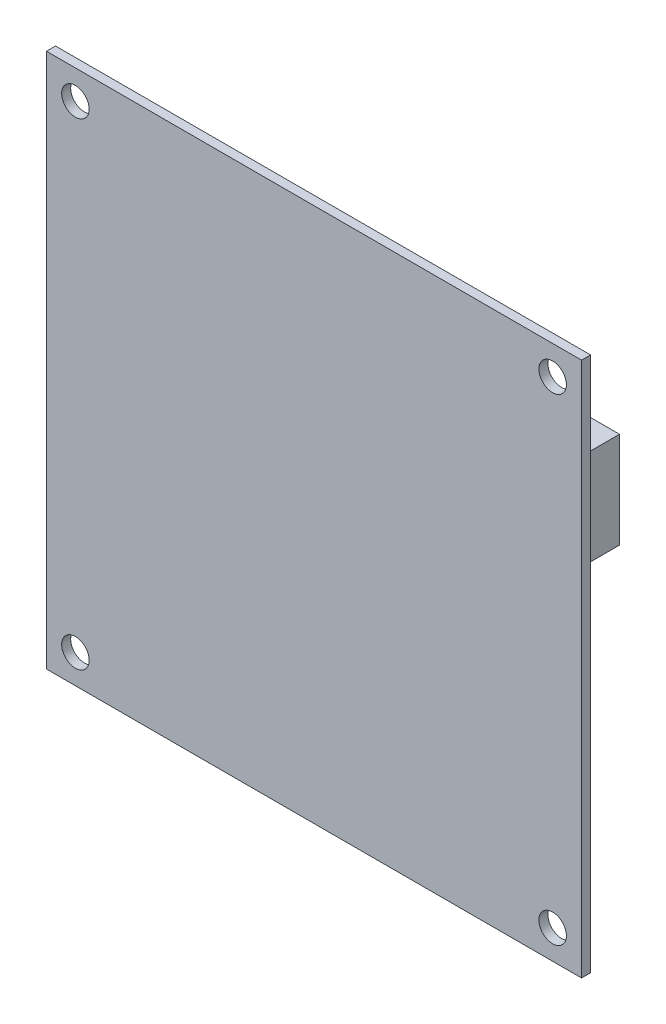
from build123d import *

# Parameters (mm, degrees)
SKETCH1_W           = 93.98
SKETCH1_H           = 93.98
SKETCH1_R           = 2.413
BOSS_EXTRUDE1_DEPTH = 1.5875
SKETCH2_W           = 0.284935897
SKETCH2_H           = 2.320192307
CUT_EXTRUDE1_DEPTH  = 0.127
SKETCH3_W           = 6.5278
SKETCH3_H           = 16.8656
BOSS_EXTRUDE2_DEPTH = 6.35


with BuildPart() as part:
    # Sketch1 → Boss-Extrude1 (new body)
    with BuildSketch(Plane.XY):
        Rectangle(SKETCH1_W, SKETCH1_H)
        with Locations((-41.91, 41.91)):
            Circle(SKETCH1_R, mode=Mode.SUBTRACT)
        with Locations((41.91, 41.91)):
            Circle(SKETCH1_R, mode=Mode.SUBTRACT)
        with Locations((41.91, -41.91)):
            Circle(SKETCH1_R, mode=Mode.SUBTRACT)
        with Locations((-41.91, -41.91)):
            Circle(SKETCH1_R, mode=Mode.SUBTRACT)
    extrude(amount=BOSS_EXTRUDE1_DEPTH)

    # Sketch2 → Cut-Extrude1 (cut)
    # profile 1 of 22: a face of its own
    with BuildSketch(Plane(origin=(0, 0, 0), x_dir=(-1, 0, 0), z_dir=(0, 0, -1))):
        Polygon((28.282190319, -42.83528653), (27.997254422, -42.83528653), (27.997254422, -39.985927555), (26.776100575, -39.985927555), (26.776100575, -39.66028653), (28.282190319, -39.66028653), align=None)
    # profile 2 of 22: a face of its own
    with BuildSketch(Plane(origin=(0, 0, 0), x_dir=(-1, 0, 0), z_dir=(0, 0, -1))):
        Polygon((26.613280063, -42.509645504), (26.613280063, -42.83528653), (24.944369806, -42.83528653), (24.944369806, -42.509645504), (25.636356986, -42.509645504), (25.636356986, -39.66028653), (25.921292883, -39.66028653), (25.921292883, -42.509645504), align=None)
    # profile 3 of 22: a face of its own
    with BuildSketch(Plane(origin=(0, 0, 0), x_dir=(-1, 0, 0), z_dir=(0, 0, -1))):
        with BuildLine():
            Line((21.443728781, -42.252694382), (21.693047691, -42.061889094))
            add(Edge.make_bspline(
                [(21.693047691, -42.061889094), (21.710833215, -42.083085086), (21.746164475, -42.125191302), (21.803002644, -42.184322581), (21.862250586, -42.239702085), (21.923825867, -42.291685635), (21.98915348, -42.338183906), (22.055744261, -42.382818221), (22.126017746, -42.4218971), (22.222699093, -42.469636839), (22.34966794, -42.518367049), (22.508948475, -42.560279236), (22.675450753, -42.586708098), (22.78901852, -42.589589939), (22.846783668, -42.59105576)],
                knots=[0, 0, 0, 0, 0.75789156, 1.505565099, 2.245254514, 2.979266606, 3.711207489, 4.440978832, 5.174393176, 5.91211879, 7.394186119, 8.890401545, 10.418332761, 12, 12, 12, 12], degree=3))
            add(Edge.make_bspline(
                [(22.846783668, -42.59105576), (22.878608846, -42.590687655), (22.941963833, -42.589954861), (23.035993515, -42.580355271), (23.128445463, -42.566707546), (23.21897588, -42.54694963), (23.307405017, -42.521226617), (23.394406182, -42.491060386), (23.478954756, -42.453521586), (23.562068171, -42.41206494), (23.641692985, -42.365226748), (23.717046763, -42.314153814), (23.787789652, -42.259350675), (23.854101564, -42.200946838), (23.915314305, -42.138260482), (23.972078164, -42.071995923), (24.024320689, -42.001853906), (24.071987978, -41.928169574), (24.114623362, -41.851306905), (24.151595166, -41.771596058), (24.182847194, -41.689341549), (24.208200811, -41.60471966), (24.228043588, -41.518029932), (24.241779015, -41.428961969), (24.251290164, -41.337671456), (24.252016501, -41.275796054), (24.252382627, -41.244606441)],
                knots=[0, 0, 0, 0, 1.054960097, 2.100129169, 3.131228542, 4.15308236, 5.169990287, 6.183953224, 7.204064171, 8.235355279, 9.262684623, 10.264978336, 11.252191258, 12.228402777, 13.192898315, 14.155264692, 15.119862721, 16.091023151, 17.063429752, 18.032246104, 19.00241354, 19.978852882, 20.959535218, 21.948948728, 22.966123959, 24, 24, 24, 24], degree=3))
            add(Edge.make_bspline(
                [(24.252382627, -41.244606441), (24.251235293, -41.19767979), (24.248982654, -41.105545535), (24.229019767, -40.970574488), (24.198440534, -40.84114801), (24.153360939, -40.718142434), (24.096666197, -40.600532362), (24.025926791, -40.489744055), (23.943688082, -40.384154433), (23.849106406, -40.286320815), (23.745321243, -40.196956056), (23.633972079, -40.118260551), (23.515331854, -40.052660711), (23.390711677, -39.998072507), (23.25915226, -39.956111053), (23.120890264, -39.926570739), (22.976226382, -39.907301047), (22.877375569, -39.905456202), (22.827067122, -39.904517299)],
                knots=[0, 0, 0, 0, 1.029159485, 2.020618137, 2.987588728, 3.942669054, 4.889339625, 5.846988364, 6.821327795, 7.821533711, 8.827683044, 9.822769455, 10.807800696, 11.797391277, 12.803701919, 13.832062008, 14.896664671, 16, 16, 16, 16], degree=3))
            add(Edge.make_bspline(
                [(22.827067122, -39.904517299), (22.771638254, -39.906049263), (22.662540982, -39.909064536), (22.502549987, -39.934608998), (22.349391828, -39.976027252), (22.203058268, -40.033991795), (22.063961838, -40.109343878), (21.931884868, -40.200691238), (21.806715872, -40.308902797), (21.731449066, -40.391528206), (21.693047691, -40.433683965)],
                knots=[0, 0, 0, 0, 1.028121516, 2.023589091, 2.998037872, 3.967518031, 4.937445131, 5.927275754, 6.942489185, 8, 8, 8, 8], degree=3))
            Line((21.693047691, -40.433683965), (21.443728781, -40.24478673))
            add(Edge.make_bspline(
                [(21.443728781, -40.24478673), (21.463793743, -40.218899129), (21.503827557, -40.167247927), (21.568640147, -40.094417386), (21.636964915, -40.02597163), (21.708986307, -39.962267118), (21.784798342, -39.902985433), (21.864367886, -39.848402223), (21.947298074, -39.797911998), (22.033692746, -39.75214854), (22.123556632, -39.711426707), (22.216119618, -39.675835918), (22.311551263, -39.645950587), (22.40909901, -39.620840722), (22.50976516, -39.602907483), (22.612397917, -39.588635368), (22.717952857, -39.580166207), (22.789103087, -39.579310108), (22.825159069, -39.578876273)],
                knots=[0, 0, 0, 0, 0.986880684, 1.969034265, 2.935876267, 3.899990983, 4.864973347, 5.834408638, 6.8063673, 7.789580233, 8.778939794, 9.778051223, 10.776304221, 11.791326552, 12.811423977, 13.855999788, 14.91350973, 16, 16, 16, 16], degree=3))
            add(Edge.make_bspline(
                [(22.825159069, -39.578876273), (22.859307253, -39.579113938), (22.926831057, -39.57958389), (23.026524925, -39.587196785), (23.123579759, -39.597583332), (23.217718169, -39.613222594), (23.309453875, -39.631677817), (23.397955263, -39.656416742), (23.484093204, -39.684129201), (23.567521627, -39.716700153), (23.648311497, -39.753454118), (23.726202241, -39.794993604), (23.801158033, -39.840969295), (23.873915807, -39.890367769), (23.943400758, -39.94477575), (24.010215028, -40.003437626), (24.074733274, -40.066155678), (24.114649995, -40.111381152), (24.134719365, -40.134119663)],
                knots=[0, 0, 0, 0, 1.114604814, 2.203992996, 3.262667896, 4.300477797, 5.318619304, 6.316056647, 7.298880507, 8.271930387, 9.238335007, 10.195173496, 11.151986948, 12.108099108, 13.064862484, 14.031167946, 15.010108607, 16, 16, 16, 16], degree=3))
            add(Edge.make_bspline(
                [(24.134719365, -40.134119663), (24.16686246, -40.173618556), (24.230760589, -40.252139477), (24.312548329, -40.379386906), (24.382324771, -40.512125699), (24.439371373, -40.651124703), (24.483189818, -40.796437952), (24.513997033, -40.947831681), (24.533876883, -41.105003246), (24.536158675, -41.21189654), (24.537318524, -41.266231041)],
                knots=[0, 0, 0, 0, 0.994611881, 1.977215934, 2.950189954, 3.921972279, 4.908960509, 5.911694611, 6.938501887, 8, 8, 8, 8], degree=3))
            add(Edge.make_bspline(
                [(24.537318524, -41.266231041), (24.535901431, -41.323338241), (24.53311339, -41.435693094), (24.509621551, -41.600622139), (24.471372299, -41.758408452), (24.418702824, -41.909659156), (24.349217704, -42.053508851), (24.265100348, -42.190565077), (24.165529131, -42.320715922), (24.051754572, -42.442297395), (23.926954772, -42.553455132), (23.793317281, -42.651251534), (23.651093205, -42.732637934), (23.501852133, -42.800670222), (23.344475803, -42.85296197), (23.179300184, -42.889568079), (23.006635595, -42.912352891), (22.888831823, -42.915233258), (22.828975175, -42.916696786)],
                knots=[0, 0, 0, 0, 1.032901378, 2.032168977, 3.007206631, 3.966850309, 4.924221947, 5.891988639, 6.871730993, 7.884084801, 8.900290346, 9.89161143, 10.874607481, 11.860025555, 12.854717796, 13.869097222, 14.917278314, 16, 16, 16, 16], degree=3))
            add(Edge.make_bspline(
                [(22.828975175, -42.916696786), (22.792494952, -42.916259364), (22.720286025, -42.915393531), (22.613466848, -42.90695231), (22.509472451, -42.89287639), (22.408013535, -42.87369325), (22.30892275, -42.849833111), (22.212645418, -42.819957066), (22.1194574, -42.783834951), (22.028730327, -42.743631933), (21.941627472, -42.697588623), (21.858192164, -42.647541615), (21.779101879, -42.592527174), (21.703842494, -42.533347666), (21.632761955, -42.469547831), (21.564793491, -42.402200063), (21.501955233, -42.329517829), (21.463173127, -42.278349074), (21.443728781, -42.252694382)],
                knots=[0, 0, 0, 0, 1.096566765, 2.170543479, 3.218870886, 4.250164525, 5.273529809, 6.281496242, 7.278154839, 8.276706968, 9.263143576, 10.238168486, 11.199979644, 12.157579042, 13.114563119, 14.070017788, 15.032356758, 16, 16, 16, 16], degree=3))
        make_face()
    # profile 4 of 22: a face of its own
    with BuildSketch(Plane(origin=(0, 0, 0), x_dir=(-1, 0, 0), z_dir=(0, 0, -1))):
        with BuildLine():
            Line((20.670331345, -41.858363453), (20.955267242, -41.858363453))
            add(Edge.make_bspline(
                [(20.955267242, -41.858363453), (20.953410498, -41.896165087), (20.949763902, -41.970406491), (20.932679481, -42.078647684), (20.908256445, -42.182121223), (20.873643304, -42.279940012), (20.8308991, -42.373272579), (20.778567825, -42.460879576), (20.717765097, -42.543630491), (20.64860246, -42.619958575), (20.573554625, -42.689731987), (20.493071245, -42.750622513), (20.407979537, -42.801480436), (20.319017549, -42.844227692), (20.225156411, -42.876275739), (20.12729333, -42.900065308), (20.024985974, -42.914375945), (19.955281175, -42.91591437), (19.919830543, -42.916696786)],
                knots=[0, 0, 0, 0, 1.100776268, 2.161895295, 3.184016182, 4.190939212, 5.176500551, 6.166955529, 7.155448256, 8.160289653, 9.16017456, 10.133824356, 11.091467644, 12.04088621, 13.000931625, 13.972173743, 14.968683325, 16, 16, 16, 16], degree=3))
            add(Edge.make_bspline(
                [(19.919830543, -42.916696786), (19.885013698, -42.915888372), (19.816599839, -42.914299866), (19.716792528, -42.900453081), (19.621552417, -42.879234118), (19.53195886, -42.847790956), (19.447092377, -42.808336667), (19.368003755, -42.759270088), (19.292780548, -42.702912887), (19.225114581, -42.636436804), (19.162955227, -42.565506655), (19.109377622, -42.489753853), (19.063236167, -42.411423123), (19.025470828, -42.329902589), (18.996843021, -42.244926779), (18.97563256, -42.157310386), (18.963507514, -42.066042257), (18.96165685, -42.004258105), (18.96071596, -41.972846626)],
                knots=[0, 0, 0, 0, 1.111674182, 2.184400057, 3.212814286, 4.223731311, 5.211378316, 6.196328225, 7.191884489, 8.207283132, 9.220262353, 10.201199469, 11.166417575, 12.120932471, 13.06540007, 14.026332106, 14.996573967, 16, 16, 16, 16], degree=3))
            add(Edge.make_bspline(
                [(18.96071596, -41.972846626), (18.962252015, -41.928625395), (18.965297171, -41.840958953), (18.991344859, -41.712130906), (19.032028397, -41.58731508), (19.081007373, -41.486857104), (19.130431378, -41.405917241), (19.174925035, -41.339242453), (19.227308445, -41.267470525), (19.287134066, -41.190310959), (19.355432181, -41.108774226), (19.430428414, -41.021196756), (19.514059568, -40.929197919), (19.572705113, -40.866320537), (19.603093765, -40.833739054)],
                knots=[0, 0, 0, 0, 1.184416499, 2.348048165, 3.509039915, 4.696071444, 5.333504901, 6.05069495, 6.844171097, 7.714965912, 8.667477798, 9.695072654, 10.805644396, 12, 12, 12, 12], degree=3))
            Line((19.603093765, -40.833739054), (20.397479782, -39.985927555))
            Line((20.397479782, -39.985927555), (18.920010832, -39.985927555))
            Line((18.920010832, -39.985927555), (18.920010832, -39.66028653))
            Line((18.920010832, -39.66028653), (21.077382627, -39.66028653))
            Line((21.077382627, -39.66028653), (19.846052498, -40.974298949))
            add(Edge.make_bspline(
                [(19.846052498, -40.974298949), (19.816071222, -41.005592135), (19.758483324, -41.06569994), (19.677065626, -41.153482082), (19.603821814, -41.234823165), (19.538703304, -41.310083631), (19.481656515, -41.378836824), (19.432863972, -41.441621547), (19.392110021, -41.497898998), (19.348919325, -41.564011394), (19.307734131, -41.644826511), (19.27153656, -41.743090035), (19.249623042, -41.844468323), (19.246980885, -41.912956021), (19.245651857, -41.947405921)],
                knots=[0, 0, 0, 0, 1.329530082, 2.553755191, 3.672934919, 4.687409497, 5.60679272, 6.413407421, 7.126401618, 7.737995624, 8.834647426, 9.90044882, 10.943907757, 12, 12, 12, 12], degree=3))
            add(Edge.make_bspline(
                [(19.245651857, -41.947405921), (19.246222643, -41.969072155), (19.247347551, -42.011772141), (19.25746346, -42.074335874), (19.272325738, -42.134919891), (19.2952331, -42.192775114), (19.322755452, -42.249039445), (19.357917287, -42.302002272), (19.39809803, -42.353468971), (19.444705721, -42.40167479), (19.495872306, -42.445838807), (19.54993456, -42.484957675), (19.607129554, -42.517650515), (19.66721893, -42.544450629), (19.73003443, -42.565474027), (19.795697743, -42.580041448), (19.864027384, -42.589187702), (19.910684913, -42.590425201), (19.934458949, -42.59105576)],
                knots=[0, 0, 0, 0, 0.991504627, 1.954065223, 2.895985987, 3.842598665, 4.797835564, 5.759220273, 6.74786863, 7.784730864, 8.824135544, 9.839918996, 10.835834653, 11.835434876, 12.84861661, 13.863796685, 14.911511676, 16, 16, 16, 16], degree=3))
            add(Edge.make_bspline(
                [(19.934458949, -42.59105576), (19.959294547, -42.590432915), (20.00806756, -42.589209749), (20.079523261, -42.579939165), (20.14816678, -42.565899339), (20.212940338, -42.543548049), (20.275199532, -42.517388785), (20.333356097, -42.48351714), (20.389043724, -42.444813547), (20.441142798, -42.399687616), (20.488593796, -42.348747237), (20.531760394, -42.293299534), (20.56833588, -42.232361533), (20.600803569, -42.167395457), (20.625634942, -42.096616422), (20.646863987, -42.021755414), (20.662284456, -41.941744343), (20.667604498, -41.886618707), (20.670331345, -41.858363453)],
                knots=[0, 0, 0, 0, 1.031072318, 2.024855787, 2.988461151, 3.935103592, 4.865765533, 5.788564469, 6.724086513, 7.67908574, 8.64457978, 9.611397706, 10.591395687, 11.591555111, 12.622101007, 13.700900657, 14.821571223, 16, 16, 16, 16], degree=3))
        make_face()
    # profile 5 of 22: a face of its own
    with BuildSketch(Plane(origin=(0, 0, 0), x_dir=(-1, 0, 0), z_dir=(0, 0, -1))):
        Polygon((17.960260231, -42.83528653), (17.37321596, -42.83528653), (17.37321596, -39.66028653), (17.658151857, -39.66028653), (17.658151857, -42.509645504), (18.146613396, -42.509645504), align=None)
    # profile 6 of 22: a face of its own
    with BuildSketch(Plane(origin=(0, 0, 0), x_dir=(-1, 0, 0), z_dir=(0, 0, -1))):
        with BuildLine():
            Line((14.19821596, -42.83528653), (14.19821596, -42.509645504))
            Line((14.19821596, -42.509645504), (15.278173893, -42.509645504))
            Line((15.278173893, -42.509645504), (15.449262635, -41.674554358))
            add(Edge.make_bspline(
                [(15.449262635, -41.674554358), (15.415647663, -41.683834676), (15.350523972, -41.701813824), (15.254403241, -41.721776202), (15.163151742, -41.733809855), (15.103937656, -41.735452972), (15.075284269, -41.736248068)],
                knots=[0, 0, 0, 0, 1.100273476, 2.13160584, 3.095893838, 4, 4, 4, 4], degree=3))
            add(Edge.make_bspline(
                [(15.075284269, -41.736248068), (15.039823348, -41.735505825), (14.970098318, -41.73404639), (14.868238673, -41.719207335), (14.770520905, -41.697699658), (14.678350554, -41.664616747), (14.590241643, -41.623956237), (14.507388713, -41.573408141), (14.429402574, -41.513692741), (14.35645369, -41.446035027), (14.290687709, -41.370705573), (14.233310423, -41.289644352), (14.184266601, -41.203755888), (14.145144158, -41.112250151), (14.113424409, -41.015989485), (14.092451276, -40.914166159), (14.07845809, -40.807627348), (14.076896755, -40.734779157), (14.076100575, -40.697631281)],
                knots=[0, 0, 0, 0, 1.052656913, 2.069786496, 3.052102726, 4.020122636, 4.972424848, 5.930457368, 6.896570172, 7.885826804, 8.881139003, 9.861434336, 10.831623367, 11.813212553, 12.812997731, 13.836986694, 14.897002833, 16, 16, 16, 16], degree=3))
            add(Edge.make_bspline(
                [(14.076100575, -40.697631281), (14.076704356, -40.67175768), (14.077903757, -40.620360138), (14.0839917, -40.544027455), (14.095751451, -40.469319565), (14.111370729, -40.396384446), (14.132139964, -40.325113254), (14.156700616, -40.25533783), (14.186098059, -40.187173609), (14.219644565, -40.12095977), (14.257811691, -40.05799957), (14.298544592, -39.997559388), (14.342929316, -39.941392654), (14.39018888, -39.888560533), (14.44123071, -39.840582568), (14.494802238, -39.795457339), (14.552101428, -39.755098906), (14.612118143, -39.717980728), (14.67481028, -39.684745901), (14.740814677, -39.657022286), (14.808682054, -39.632722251), (14.879017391, -39.612961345), (14.951684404, -39.597629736), (15.026933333, -39.587189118), (15.104386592, -39.579592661), (15.156887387, -39.579116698), (15.183407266, -39.578876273)],
                knots=[0, 0, 0, 0, 1.056281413, 2.098288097, 3.122646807, 4.141030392, 5.140675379, 6.150604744, 7.15845591, 8.168533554, 9.177684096, 10.161739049, 11.141561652, 12.097360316, 13.052218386, 13.998410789, 14.954052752, 15.909851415, 16.877523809, 17.846742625, 18.829312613, 19.818263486, 20.826374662, 21.858017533, 22.918014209, 24, 24, 24, 24], degree=3))
            add(Edge.make_bspline(
                [(15.183407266, -39.578876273), (15.215042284, -39.579504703), (15.277280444, -39.580741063), (15.36847902, -39.593614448), (15.45616894, -39.612178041), (15.539986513, -39.63966625), (15.61953757, -39.675712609), (15.695976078, -39.718265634), (15.767902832, -39.769625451), (15.835828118, -39.827950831), (15.898138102, -39.89264099), (15.955501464, -39.961416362), (16.005170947, -40.035802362), (16.048328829, -40.114557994), (16.085042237, -40.197888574), (16.113909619, -40.285987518), (16.137201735, -40.378426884), (16.14705666, -40.442065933), (16.152062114, -40.474389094)],
                knots=[0, 0, 0, 0, 1.04695683, 2.059763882, 3.044413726, 4.012427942, 4.974081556, 5.932886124, 6.904940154, 7.895678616, 8.893654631, 9.876199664, 10.857615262, 11.850515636, 12.847107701, 13.868396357, 14.917328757, 16, 16, 16, 16], degree=3))
            Line((16.152062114, -40.474389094), (15.867126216, -40.474389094))
            add(Edge.make_bspline(
                [(15.867126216, -40.474389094), (15.860124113, -40.444105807), (15.846665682, -40.385899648), (15.81697047, -40.304218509), (15.781237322, -40.23112804), (15.73677672, -40.167087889), (15.686274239, -40.109942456), (15.627986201, -40.059124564), (15.562407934, -40.013830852), (15.48952479, -39.975767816), (15.412436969, -39.943752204), (15.332227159, -39.920893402), (15.250034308, -39.907059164), (15.194696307, -39.905367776), (15.166870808, -39.904517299)],
                knots=[0, 0, 0, 0, 1.136370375, 2.184166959, 3.172867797, 4.104539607, 5.027679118, 5.956634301, 6.927059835, 7.936867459, 8.959641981, 9.976160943, 10.98235693, 12, 12, 12, 12], degree=3))
            add(Edge.make_bspline(
                [(15.166870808, -39.904517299), (15.139696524, -39.905268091), (15.086190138, -39.906746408), (15.007406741, -39.917941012), (14.931566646, -39.93563486), (14.858535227, -39.960422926), (14.788671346, -39.993216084), (14.722073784, -40.03350059), (14.657793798, -40.08027138), (14.597523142, -40.133728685), (14.54233598, -40.192672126), (14.493570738, -40.25569631), (14.45295188, -40.322931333), (14.4187216, -40.393210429), (14.392728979, -40.467304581), (14.374186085, -40.544866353), (14.363297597, -40.626087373), (14.361799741, -40.681485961), (14.361036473, -40.709715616)],
                knots=[0, 0, 0, 0, 1.027268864, 2.022700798, 3.002744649, 3.968653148, 4.933396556, 5.915045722, 6.907600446, 7.935526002, 8.956456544, 9.95700807, 10.942805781, 11.92166854, 12.907987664, 13.905483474, 14.932689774, 16, 16, 16, 16], degree=3))
            add(Edge.make_bspline(
                [(14.361036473, -40.709715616), (14.361518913, -40.735202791), (14.362459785, -40.784908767), (14.373586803, -40.857562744), (14.38857402, -40.926914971), (14.41221156, -40.992317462), (14.440922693, -41.054453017), (14.47833211, -41.111786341), (14.51969065, -41.167120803), (14.569220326, -41.216798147), (14.622849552, -41.263031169), (14.682280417, -41.302243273), (14.745814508, -41.335605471), (14.81359989, -41.362935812), (14.88571181, -41.384707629), (14.962191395, -41.399754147), (15.043055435, -41.408757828), (15.098369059, -41.409979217), (15.126801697, -41.410607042)],
                knots=[0, 0, 0, 0, 1.045820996, 2.039596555, 3.013371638, 3.9552447, 4.890047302, 5.817684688, 6.761648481, 7.722253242, 8.692244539, 9.66551337, 10.63924952, 11.635311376, 12.662847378, 13.728455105, 14.832366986, 16, 16, 16, 16], degree=3))
            add(Edge.make_bspline(
                [(15.126801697, -41.410607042), (15.151625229, -41.410098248), (15.202442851, -41.409056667), (15.280574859, -41.400859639), (15.362322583, -41.388249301), (15.448003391, -41.37007378), (15.537382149, -41.347316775), (15.630607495, -41.31889613), (15.72768168, -41.286159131), (15.793019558, -41.260767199), (15.826421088, -41.24778653)],
                knots=[0, 0, 0, 0, 0.824638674, 1.688163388, 2.607705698, 3.571998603, 4.597075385, 5.671199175, 6.809488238, 8, 8, 8, 8], degree=3))
            Line((15.826421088, -41.24778653), (15.500780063, -42.83528653))
            Line((15.500780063, -42.83528653), (14.19821596, -42.83528653))
        make_face()
    # profile 7 of 22: a face of its own
    with BuildSketch(Plane(origin=(0, 0, 0), x_dir=(-1, 0, 0), z_dir=(0, 0, -1))):
        with BuildLine():
            Line((12.285074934, -42.916696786), (12.065648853, -42.744336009))
            Line((12.065648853, -42.744336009), (12.904556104, -41.461488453))
            add(Edge.make_bspline(
                [(12.904556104, -41.461488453), (12.848703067, -41.470391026), (12.739755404, -41.487756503), (12.629477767, -41.49062121), (12.57573499, -41.492017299)],
                knots=[0, 0, 0, 0, 1.025318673, 2, 2, 2, 2], degree=3))
            add(Edge.make_bspline(
                [(12.57573499, -41.492017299), (12.543465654, -41.491149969), (12.479944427, -41.489442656), (12.386683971, -41.476303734), (12.29706829, -41.455598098), (12.211468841, -41.425415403), (12.129578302, -41.386859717), (12.050927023, -41.340650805), (11.976992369, -41.2844031), (11.906826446, -41.221568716), (11.843110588, -41.15197982), (11.786743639, -41.078121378), (11.739137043, -40.999999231), (11.701208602, -40.917630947), (11.670897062, -40.831661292), (11.649318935, -40.74175498), (11.636419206, -40.647760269), (11.634677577, -40.583824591), (11.633792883, -40.551347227)],
                knots=[0, 0, 0, 0, 1.043709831, 2.054511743, 3.041122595, 4.01515914, 4.98481438, 5.965901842, 6.960491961, 7.985277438, 9.0096037, 10.00832444, 10.987059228, 11.962929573, 12.936966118, 13.931840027, 14.949438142, 16, 16, 16, 16], degree=3))
            add(Edge.make_bspline(
                [(11.633792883, -40.551347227), (11.635446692, -40.506940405), (11.638699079, -40.419609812), (11.66246408, -40.291909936), (11.703174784, -40.1713013), (11.758516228, -40.057468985), (11.828950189, -39.95279688), (11.913430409, -39.858515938), (12.011539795, -39.77633691), (12.121324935, -39.705869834), (12.2401305, -39.649875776), (12.364706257, -39.60848029), (12.49398225, -39.583744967), (12.58177862, -39.580506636), (12.625980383, -39.578876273)],
                knots=[0, 0, 0, 0, 1.0319111, 2.029359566, 3.00642934, 3.98275322, 4.962714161, 5.929339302, 6.915525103, 7.928435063, 8.953439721, 9.960121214, 10.9730072, 12, 12, 12, 12], degree=3))
            add(Edge.make_bspline(
                [(12.625980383, -39.578876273), (12.668705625, -39.580258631), (12.753336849, -39.58299684), (12.877800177, -39.607516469), (12.99760662, -39.646975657), (13.111215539, -39.702478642), (13.216639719, -39.771398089), (13.31168179, -39.853802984), (13.393936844, -39.949746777), (13.462640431, -40.057439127), (13.518863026, -40.172248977), (13.558146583, -40.293265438), (13.583687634, -40.417980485), (13.586316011, -40.502885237), (13.587639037, -40.545623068)],
                knots=[0, 0, 0, 0, 1.01206923, 2.004731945, 2.994948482, 3.995280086, 4.993424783, 5.973125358, 6.967517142, 7.97830003, 8.994392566, 9.989381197, 10.98793077, 12, 12, 12, 12], degree=3))
            add(Edge.make_bspline(
                [(13.587639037, -40.545623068), (13.586488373, -40.578308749), (13.584139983, -40.645016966), (13.570125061, -40.746340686), (13.544419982, -40.849610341), (13.516601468, -40.937154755), (13.488997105, -41.00965739), (13.463401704, -41.066910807), (13.434782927, -41.127372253), (13.401237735, -41.189897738), (13.365677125, -41.256273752), (13.324138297, -41.324042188), (13.280791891, -41.395678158), (13.249037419, -41.443372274), (13.2327412, -41.467848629)],
                knots=[0, 0, 0, 0, 1.17367173, 2.395347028, 3.66355231, 4.98980831, 5.690886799, 6.447442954, 7.240630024, 8.091733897, 8.994365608, 9.943299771, 10.944512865, 12, 12, 12, 12], degree=3))
            Line((13.2327412, -41.467848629), (12.285074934, -42.916696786))
        make_face()
        with BuildLine():
            add(Edge.make_bspline(
                [(12.635520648, -41.166376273), (12.659708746, -41.165667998), (12.707165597, -41.164278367), (12.776663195, -41.156256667), (12.842477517, -41.141574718), (12.904500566, -41.12090842), (12.963647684, -41.095659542), (13.018979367, -41.063640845), (13.070867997, -41.025987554), (13.118115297, -40.982649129), (13.161511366, -40.935924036), (13.198836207, -40.885569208), (13.231068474, -40.833132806), (13.257266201, -40.778119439), (13.277668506, -40.720565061), (13.292425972, -40.660730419), (13.300639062, -40.598215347), (13.302005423, -40.555822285), (13.30270314, -40.534174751)],
                knots=[0, 0, 0, 0, 1.129540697, 2.216149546, 3.260829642, 4.271906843, 5.264942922, 6.258225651, 7.250175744, 8.252297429, 9.247108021, 10.223125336, 11.173816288, 12.116901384, 13.062424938, 14.020354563, 14.989116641, 16, 16, 16, 16], degree=3))
            add(Edge.make_bspline(
                [(13.30270314, -40.534174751), (13.302113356, -40.512725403), (13.300951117, -40.470456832), (13.291101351, -40.40839684), (13.275246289, -40.348866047), (13.252707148, -40.291738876), (13.223912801, -40.237102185), (13.189473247, -40.184295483), (13.147712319, -40.134724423), (13.100271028, -40.088083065), (13.048720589, -40.04540241), (12.994315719, -40.007243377), (12.936861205, -39.975570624), (12.876968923, -39.949096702), (12.81388644, -39.929647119), (12.748682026, -39.914746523), (12.680457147, -39.906602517), (12.634268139, -39.905221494), (12.61071596, -39.904517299)],
                knots=[0, 0, 0, 0, 0.98953633, 1.950002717, 2.892353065, 3.828177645, 4.777967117, 5.738732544, 6.732276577, 7.76327951, 8.805689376, 9.818183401, 10.825652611, 11.829169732, 12.834974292, 13.867693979, 14.912718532, 16, 16, 16, 16], degree=3))
            add(Edge.make_bspline(
                [(12.61071596, -39.904517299), (12.587163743, -39.905221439), (12.540974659, -39.906602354), (12.472750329, -39.91474714), (12.407543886, -39.929644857), (12.344468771, -39.949104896), (12.284549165, -39.975540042), (12.227044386, -40.007443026), (12.172120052, -40.045171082), (12.120603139, -40.08815687), (12.072963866, -40.134459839), (12.032162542, -40.18474861), (11.996612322, -40.236686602), (11.96891611, -40.291956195), (11.946124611, -40.348832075), (11.930347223, -40.408406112), (11.920476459, -40.470454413), (11.919317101, -40.512724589), (11.918728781, -40.534174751)],
                knots=[0, 0, 0, 0, 1.087095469, 2.131941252, 3.164484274, 4.170116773, 5.173462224, 6.180759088, 7.201132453, 8.243363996, 9.274190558, 10.261329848, 11.227346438, 12.172477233, 13.108141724, 14.050330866, 15.010632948, 16, 16, 16, 16], degree=3))
            add(Edge.make_bspline(
                [(11.918728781, -40.534174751), (11.919222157, -40.555853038), (11.920190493, -40.598400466), (11.931355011, -40.660674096), (11.946434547, -40.721051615), (11.970804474, -40.778172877), (11.999830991, -40.833617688), (12.036809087, -40.885800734), (12.079204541, -40.936202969), (12.128305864, -40.982958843), (12.181711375, -41.025755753), (12.238549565, -41.063420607), (12.297773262, -41.095572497), (12.360219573, -41.120942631), (12.425047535, -41.141381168), (12.492704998, -41.156158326), (12.563240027, -41.164290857), (12.611120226, -41.16567228), (12.635520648, -41.166376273)],
                knots=[0, 0, 0, 0, 0.978317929, 1.920119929, 2.851929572, 3.784133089, 4.71845084, 5.67514162, 6.667477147, 7.690549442, 8.733345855, 9.756283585, 10.767808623, 11.772962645, 12.797066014, 13.836159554, 14.89727653, 16, 16, 16, 16], degree=3))
        make_face(mode=Mode.SUBTRACT)
    # profile 8 of 22: a face of its own
    with BuildSketch(Plane(origin=(0, 0, 0), x_dir=(-1, 0, 0), z_dir=(0, 0, -1))):
        Polygon((9.720651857, -42.83528653), (8.255267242, -39.66028653), (8.565007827, -39.66028653), (9.034388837, -40.677914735), (10.473696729, -40.677914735), (10.956434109, -39.66028653), (11.267446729, -39.66028653), (9.761356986, -42.83528653), align=None)
        Polygon((9.74418451, -42.216441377), (10.319144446, -41.00355576), (9.184488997, -41.00355576), align=None, mode=Mode.SUBTRACT)
    # profile 9 of 22: a face of its own
    with BuildSketch(Plane(origin=(0, 0, 0), x_dir=(-1, 0, 0), z_dir=(0, 0, -1))):
        Polygon((6.545651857, -42.83528653), (4.754626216, -42.83528653), (4.754626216, -42.509645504), (6.26071596, -42.509645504), (6.26071596, -41.532722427), (4.754626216, -41.532722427), (4.754626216, -41.207081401), (6.26071596, -41.207081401), (6.26071596, -39.985927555), (4.754626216, -39.985927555), (4.754626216, -39.66028653), (6.545651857, -39.66028653), align=None)
    # profile 10 of 22: a face of its own
    with BuildSketch(Plane(origin=(0, 0, 0), x_dir=(-1, 0, 0), z_dir=(0, 0, -1))):
        with BuildLine():
            Line((4.266164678, -41.980478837), (3.981228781, -41.980478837))
            Line((3.981228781, -41.980478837), (3.981228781, -41.561979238))
            add(Edge.make_bspline(
                [(3.981228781, -41.561979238), (3.950857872, -41.599993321), (3.892014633, -41.67364511), (3.793012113, -41.769686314), (3.68978194, -41.850280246), (3.580647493, -41.91373638), (3.466731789, -41.961728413), (3.348358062, -41.996336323), (3.224885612, -42.017099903), (3.140916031, -42.019811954), (3.098436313, -42.021183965)],
                knots=[0, 0, 0, 0, 1.127869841, 2.185233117, 3.191641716, 4.159226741, 5.10472073, 6.052603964, 7.014823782, 8, 8, 8, 8], degree=3))
            add(Edge.make_bspline(
                [(3.098436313, -42.021183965), (3.055480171, -42.019690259), (2.971362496, -42.016765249), (2.849328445, -41.99099209), (2.734554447, -41.9502059), (2.628575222, -41.892882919), (2.533021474, -41.821712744), (2.450160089, -41.738229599), (2.380477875, -41.643439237), (2.333968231, -41.554713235), (2.303886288, -41.475901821), (2.284117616, -41.408492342), (2.26812434, -41.333359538), (2.253793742, -41.250689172), (2.24423366, -41.160149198), (2.236655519, -41.061955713), (2.231235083, -40.956125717), (2.231019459, -40.882931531), (2.230908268, -40.845187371)],
                knots=[0, 0, 0, 0, 1.235764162, 2.419900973, 3.574701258, 4.732869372, 5.875730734, 6.993815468, 8.107424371, 9.251605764, 9.866123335, 10.534503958, 11.272175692, 12.077112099, 12.949509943, 13.89253218, 14.913238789, 16, 16, 16, 16], degree=3))
            Line((2.230908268, -40.845187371), (2.230908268, -39.66028653))
            Line((2.230908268, -39.66028653), (2.515844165, -39.66028653))
            Line((2.515844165, -39.66028653), (2.515844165, -40.75169278))
            add(Edge.make_bspline(
                [(2.515844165, -40.75169278), (2.516018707, -40.783281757), (2.516352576, -40.843706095), (2.517419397, -40.930218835), (2.519930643, -41.008464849), (2.523604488, -41.078669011), (2.528746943, -41.140574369), (2.534252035, -41.194494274), (2.540928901, -41.239951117), (2.546882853, -41.26731512), (2.549553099, -41.279587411)],
                knots=[0, 0, 0, 0, 1.430803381, 2.736883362, 3.918614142, 4.976458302, 5.92063272, 6.731858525, 7.431260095, 8, 8, 8, 8], degree=3))
            add(Edge.make_bspline(
                [(2.549553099, -41.279587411), (2.559144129, -41.315637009), (2.577554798, -41.384836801), (2.623973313, -41.47854044), (2.681230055, -41.558964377), (2.752169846, -41.624454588), (2.834887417, -41.675437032), (2.92952028, -41.710784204), (3.035089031, -41.732899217), (3.109343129, -41.735100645), (3.148045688, -41.736248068)],
                knots=[0, 0, 0, 0, 1.084232, 2.08126119, 3.027460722, 3.945137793, 4.874029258, 5.839697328, 6.874011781, 8, 8, 8, 8], degree=3))
            add(Edge.make_bspline(
                [(3.148045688, -41.736248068), (3.170969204, -41.735822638), (3.216334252, -41.734980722), (3.283567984, -41.726314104), (3.348990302, -41.712626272), (3.412425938, -41.692408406), (3.474003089, -41.667826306), (3.533976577, -41.637662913), (3.591508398, -41.601177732), (3.647407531, -41.560168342), (3.699363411, -41.514499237), (3.748396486, -41.467006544), (3.791478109, -41.415701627), (3.830584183, -41.362398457), (3.8643005, -41.306026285), (3.89374268, -41.247187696), (3.918720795, -41.185789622), (3.931133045, -41.143176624), (3.937343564, -41.121855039)],
                knots=[0, 0, 0, 0, 1.023939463, 2.026349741, 3.024227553, 4.007104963, 4.997624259, 5.984875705, 7.002218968, 8.038748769, 9.079772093, 10.091408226, 11.086177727, 12.069739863, 13.043026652, 14.017557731, 15.008077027, 16, 16, 16, 16], degree=3))
            add(Edge.make_bspline(
                [(3.937343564, -41.121855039), (3.940917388, -41.106202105), (3.948697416, -41.072126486), (3.957100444, -41.016206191), (3.964727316, -40.951517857), (3.971110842, -40.878136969), (3.97501647, -40.795806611), (3.979274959, -40.704878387), (3.980825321, -40.604989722), (3.981090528, -40.535446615), (3.981228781, -40.499193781)],
                knots=[0, 0, 0, 0, 0.615963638, 1.340920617, 2.168419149, 3.115676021, 4.16674242, 5.331190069, 6.6087489, 8, 8, 8, 8], degree=3))
            Line((3.981228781, -40.499193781), (3.981228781, -39.66028653))
            Line((3.981228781, -39.66028653), (4.266164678, -39.66028653))
            Line((4.266164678, -39.66028653), (4.266164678, -41.980478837))
        make_face()
    # profile 11 of 22: a face of its own
    with BuildSketch(Plane(origin=(0, 0, 0), x_dir=(-1, 0, 0), z_dir=(0, 0, -1))):
        with BuildLine():
            Line((-0.324610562, -40.392978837), (-0.577745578, -40.260051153))
            add(Edge.make_bspline(
                [(-0.577745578, -40.260051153), (-0.557560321, -40.224281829), (-0.518287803, -40.15468889), (-0.451074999, -40.059023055), (-0.379885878, -39.973767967), (-0.303305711, -39.89932386), (-0.222295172, -39.833941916), (-0.135647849, -39.777919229), (-0.0448055, -39.729278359), (0.051549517, -39.689633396), (0.153325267, -39.658428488), (0.261148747, -39.635393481), (0.375518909, -39.622032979), (0.453839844, -39.62041162), (0.493944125, -39.619581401)],
                knots=[0, 0, 0, 0, 1.120547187, 2.180141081, 3.186367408, 4.148075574, 5.090720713, 6.023293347, 6.960451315, 7.899733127, 8.862572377, 9.862522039, 10.90550313, 12, 12, 12, 12], degree=3))
            add(Edge.make_bspline(
                [(0.493944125, -39.619581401), (0.538522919, -39.620622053), (0.625483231, -39.622652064), (0.752065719, -39.640153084), (0.871245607, -39.668703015), (0.983016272, -39.708586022), (1.087103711, -39.76068088), (1.183715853, -39.82414386), (1.273356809, -39.898650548), (1.353216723, -39.984840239), (1.42506744, -40.077094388), (1.48862595, -40.173160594), (1.541147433, -40.272998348), (1.585976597, -40.375091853), (1.619146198, -40.480799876), (1.643910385, -40.589191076), (1.657785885, -40.700662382), (1.659947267, -40.77603785), (1.661036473, -40.814022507)],
                knots=[0, 0, 0, 0, 1.145213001, 2.233978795, 3.276616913, 4.289988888, 5.2768102, 6.260573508, 7.254647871, 8.264498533, 9.273731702, 10.25749501, 11.220258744, 12.169609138, 13.119022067, 14.062790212, 15.023763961, 16, 16, 16, 16], degree=3))
            add(Edge.make_bspline(
                [(1.661036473, -40.814022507), (1.66007568, -40.849668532), (1.658171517, -40.920314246), (1.646169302, -41.024876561), (1.624898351, -41.126502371), (1.595709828, -41.225276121), (1.558016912, -41.321032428), (1.511904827, -41.413829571), (1.457301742, -41.503568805), (1.415144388, -41.560177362), (1.393909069, -41.588691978)],
                knots=[0, 0, 0, 0, 1.024358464, 2.0301432, 3.019427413, 4.004406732, 4.986367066, 5.972626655, 6.978780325, 8, 8, 8, 8], degree=3))
            add(Edge.make_bspline(
                [(1.393909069, -41.588691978), (1.365195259, -41.623101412), (1.308769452, -41.690719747), (1.212343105, -41.778757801), (1.109337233, -41.854066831), (0.998715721, -41.915504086), (0.880664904, -41.962759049), (0.755793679, -41.996370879), (0.623756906, -42.017285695), (0.533244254, -42.019864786), (0.486947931, -42.021183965)],
                knots=[0, 0, 0, 0, 1.030811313, 2.025658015, 2.997072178, 3.962767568, 4.930766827, 5.917075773, 6.934604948, 8, 8, 8, 8], degree=3))
            add(Edge.make_bspline(
                [(0.486947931, -42.021183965), (0.439367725, -42.019961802), (0.346026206, -42.017564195), (0.209964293, -41.995137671), (0.080966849, -41.960005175), (-0.039901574, -41.908818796), (-0.154503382, -41.845369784), (-0.260201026, -41.765173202), (-0.359895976, -41.672348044), (-0.417864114, -41.600887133), (-0.447361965, -41.564523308)],
                knots=[0, 0, 0, 0, 1.056389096, 2.072394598, 3.055233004, 4.020130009, 4.981825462, 5.957811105, 6.960805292, 8, 8, 8, 8], degree=3))
            add(Edge.make_bspline(
                [(-0.447361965, -41.564523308), (-0.467434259, -41.537124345), (-0.50744524, -41.482508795), (-0.557562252, -41.393453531), (-0.60106646, -41.300280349), (-0.635839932, -41.201483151), (-0.663997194, -41.098232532), (-0.684368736, -40.989790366), (-0.696315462, -40.876188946), (-0.69866378, -40.798785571), (-0.699860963, -40.759324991)],
                knots=[0, 0, 0, 0, 0.94817472, 1.890038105, 2.849395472, 3.817997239, 4.812318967, 5.836947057, 6.897266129, 8, 8, 8, 8], degree=3))
            Line((-0.699860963, -40.759324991), (1.376100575, -40.759324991))
            add(Edge.make_bspline(
                [(1.376100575, -40.759324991), (1.374702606, -40.728754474), (1.371953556, -40.668638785), (1.359167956, -40.580663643), (1.338916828, -40.496899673), (1.310767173, -40.417703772), (1.275470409, -40.342815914), (1.233591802, -40.27171998), (1.183324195, -40.205495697), (1.127349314, -40.143284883), (1.065013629, -40.087904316), (0.999457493, -40.038297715), (0.929820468, -39.996950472), (0.856804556, -39.962883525), (0.780031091, -39.93666332), (0.699608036, -39.918607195), (0.615785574, -39.906544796), (0.558649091, -39.905201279), (0.529561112, -39.904517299)],
                knots=[0, 0, 0, 0, 1.094405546, 2.152104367, 3.174987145, 4.173015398, 5.153654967, 6.133208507, 7.119289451, 8.123438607, 9.122504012, 10.097966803, 11.060604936, 12.014205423, 12.976096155, 13.956823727, 14.959826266, 16, 16, 16, 16], degree=3))
            add(Edge.make_bspline(
                [(0.529561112, -39.904517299), (0.501119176, -39.905060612), (0.444684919, -39.906138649), (0.360469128, -39.916929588), (0.277423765, -39.933748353), (0.196625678, -39.958152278), (0.119368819, -39.987013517), (0.047221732, -40.020759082), (-0.019138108, -40.058794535), (-0.081041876, -40.102691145), (-0.140759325, -40.156005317), (-0.200188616, -40.222661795), (-0.263340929, -40.301966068), (-0.303418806, -40.361499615), (-0.324610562, -40.392978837)],
                knots=[0, 0, 0, 0, 0.991026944, 1.966387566, 2.954903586, 3.941705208, 4.905318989, 5.827751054, 6.715113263, 7.568237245, 8.468614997, 9.499196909, 10.677664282, 12, 12, 12, 12], degree=3))
        make_face()
        with BuildLine():
            add(Edge.make_bspline(
                [(-0.414925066, -41.044260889), (-0.404555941, -41.082082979), (-0.384650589, -41.154689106), (-0.341990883, -41.254960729), (-0.296175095, -41.345101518), (-0.239912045, -41.422832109), (-0.17623947, -41.491499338), (-0.102465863, -41.551145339), (-0.021028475, -41.605856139), (0.069553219, -41.651464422), (0.165778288, -41.688930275), (0.265648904, -41.716482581), (0.36833403, -41.732677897), (0.437494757, -41.735052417), (0.472319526, -41.736248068)],
                knots=[0, 0, 0, 0, 1.154958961, 2.217145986, 3.207012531, 4.129872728, 5.036522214, 5.960144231, 6.920619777, 7.92424629, 8.943461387, 9.961007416, 10.973298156, 12, 12, 12, 12], degree=3))
            add(Edge.make_bspline(
                [(0.472319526, -41.736248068), (0.500759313, -41.735697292), (0.556978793, -41.734608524), (0.639782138, -41.724144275), (0.719652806, -41.707106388), (0.796207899, -41.682728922), (0.869620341, -41.652075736), (0.940226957, -41.61518486), (1.007177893, -41.570298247), (1.049031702, -41.536038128), (1.070176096, -41.518730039)],
                knots=[0, 0, 0, 0, 1.04879286, 2.073242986, 3.073461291, 4.057960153, 5.032623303, 6.005244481, 6.992256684, 8, 8, 8, 8], degree=3))
            add(Edge.make_bspline(
                [(1.070176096, -41.518730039), (1.085321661, -41.505038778), (1.115972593, -41.477331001), (1.156884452, -41.42956633), (1.196348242, -41.378031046), (1.231417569, -41.320475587), (1.264745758, -41.258568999), (1.29511638, -41.191859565), (1.322730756, -41.120065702), (1.338232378, -41.070012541), (1.346207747, -41.044260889)],
                knots=[0, 0, 0, 0, 0.879905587, 1.780714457, 2.708106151, 3.677566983, 4.684151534, 5.740052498, 6.837288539, 8, 8, 8, 8], degree=3))
            Line((1.346207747, -41.044260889), (-0.414925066, -41.044260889))
        make_face(mode=Mode.SUBTRACT)
    # profile 12 of 22: a face of its own
    with BuildSketch(Plane(origin=(0, 0, 0), x_dir=(-1, 0, 0), z_dir=(0, 0, -1))):
        with BuildLine():
            Line((-1.188322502, -41.980478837), (-1.473258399, -41.980478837))
            Line((-1.473258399, -41.980478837), (-1.473258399, -41.638937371))
            add(Edge.make_bspline(
                [(-1.473258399, -41.638937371), (-1.494277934, -41.670755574), (-1.534477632, -41.731607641), (-1.601647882, -41.811928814), (-1.669695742, -41.879490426), (-1.740936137, -41.932039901), (-1.813557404, -41.972084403), (-1.887344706, -42.000464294), (-1.962830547, -42.017762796), (-2.013785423, -42.020042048), (-2.039314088, -42.021183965)],
                knots=[0, 0, 0, 0, 1.280240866, 2.448450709, 3.511242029, 4.49418232, 5.41222037, 6.289222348, 7.142891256, 8, 8, 8, 8], degree=3))
            add(Edge.make_bspline(
                [(-2.039314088, -42.021183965), (-2.059120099, -42.020128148), (-2.099665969, -42.017966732), (-2.16123023, -42.002020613), (-2.224921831, -41.977527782), (-2.266023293, -41.953931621), (-2.287360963, -41.941681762)],
                knots=[0, 0, 0, 0, 0.90119973, 1.844890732, 2.881183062, 4, 4, 4, 4], degree=3))
            Line((-2.287360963, -41.941681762), (-2.130900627, -41.694906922))
            add(Edge.make_bspline(
                [(-2.130900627, -41.694906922), (-2.117194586, -41.701021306), (-2.091177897, -41.712627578), (-2.053119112, -41.726363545), (-2.018029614, -41.734451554), (-1.995674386, -41.735676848), (-1.98525259, -41.736248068)],
                knots=[0, 0, 0, 0, 1.180555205, 2.24091978, 3.179933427, 4, 4, 4, 4], degree=3))
            add(Edge.make_bspline(
                [(-1.98525259, -41.736248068), (-1.962150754, -41.734792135), (-1.915450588, -41.731848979), (-1.847215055, -41.706702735), (-1.78011589, -41.668909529), (-1.728004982, -41.624329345), (-1.687205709, -41.582322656), (-1.657845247, -41.545356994), (-1.631476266, -41.503551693), (-1.605902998, -41.458490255), (-1.582142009, -41.409051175), (-1.560908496, -41.355151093), (-1.541050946, -41.297235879), (-1.52986811, -41.256966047), (-1.524139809, -41.236338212)],
                knots=[0, 0, 0, 0, 1.1355652, 2.295535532, 3.545064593, 4.917862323, 5.656949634, 6.430545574, 7.239270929, 8.090880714, 8.983622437, 9.940313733, 10.94494545, 12, 12, 12, 12], degree=3))
            add(Edge.make_bspline(
                [(-1.524139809, -41.236338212), (-1.519839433, -41.217944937), (-1.510266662, -41.177000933), (-1.501207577, -41.108622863), (-1.491896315, -41.027888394), (-1.48553766, -40.934703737), (-1.479531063, -40.828710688), (-1.476212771, -40.7103665), (-1.473363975, -40.579345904), (-1.473294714, -40.487959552), (-1.473258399, -40.440044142)],
                knots=[0, 0, 0, 0, 0.566841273, 1.261806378, 2.068780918, 3.007109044, 4.065315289, 5.256255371, 6.561408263, 8, 8, 8, 8], degree=3))
            Line((-1.473258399, -40.440044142), (-1.473258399, -39.66028653))
            Line((-1.473258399, -39.66028653), (-1.188322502, -39.66028653))
            Line((-1.188322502, -39.66028653), (-1.188322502, -41.980478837))
        make_face()
    # profile 13 of 22: a face of its own
    with BuildSketch(Plane(origin=(0, 0, 0), x_dir=(-1, 0, 0), z_dir=(0, 0, -1))):
        with BuildLine():
            Line((-4.607553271, -41.980478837), (-4.892489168, -41.980478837))
            Line((-4.892489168, -41.980478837), (-4.892489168, -40.139207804))
            add(Edge.make_bspline(
                [(-4.892489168, -40.139207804), (-4.892237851, -40.099985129), (-4.891752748, -40.024275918), (-4.888259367, -39.914803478), (-4.880892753, -39.813687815), (-4.872539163, -39.720467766), (-4.860522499, -39.635575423), (-4.845848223, -39.558757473), (-4.829305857, -39.489940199), (-4.814773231, -39.447554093), (-4.807898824, -39.427504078)],
                knots=[0, 0, 0, 0, 1.307562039, 2.523909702, 3.650326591, 4.686913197, 5.643429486, 6.506965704, 7.293745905, 8, 8, 8, 8], degree=3))
            add(Edge.make_bspline(
                [(-4.807898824, -39.427504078), (-4.797749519, -39.401441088), (-4.777754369, -39.350094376), (-4.740288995, -39.277322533), (-4.698397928, -39.208746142), (-4.650395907, -39.145129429), (-4.597439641, -39.085543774), (-4.538871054, -39.030848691), (-4.474833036, -38.981112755), (-4.405899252, -38.935864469), (-4.332560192, -38.895429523), (-4.255217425, -38.860185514), (-4.174064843, -38.831039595), (-4.089461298, -38.807007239), (-4.001369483, -38.787632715), (-3.909507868, -38.774702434), (-3.814183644, -38.76599668), (-3.749373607, -38.765185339), (-3.716492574, -38.764773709)],
                knots=[0, 0, 0, 0, 0.981980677, 1.934600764, 2.870922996, 3.801898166, 4.730277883, 5.66822786, 6.612778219, 7.575390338, 8.562104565, 9.552017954, 10.558022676, 11.588218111, 12.640020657, 13.7238485, 14.84520645, 16, 16, 16, 16], degree=3))
            add(Edge.make_bspline(
                [(-3.716492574, -38.764773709), (-3.668531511, -38.765646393), (-3.574875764, -38.767350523), (-3.438057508, -38.783695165), (-3.308710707, -38.809895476), (-3.187705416, -38.847613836), (-3.075962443, -38.89405789), (-2.973844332, -38.946839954), (-2.883055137, -39.008001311), (-2.801286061, -39.07737113), (-2.727501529, -39.159895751), (-2.658079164, -39.257138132), (-2.591258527, -39.370592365), (-2.552098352, -39.453861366), (-2.531591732, -39.497466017)],
                knots=[0, 0, 0, 0, 1.157891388, 2.261067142, 3.322482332, 4.341146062, 5.316743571, 6.242014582, 7.11254001, 7.955027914, 8.825041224, 9.77858257, 10.836732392, 12, 12, 12, 12], degree=3))
            Line((-2.531591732, -39.497466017), (-2.81652763, -39.497466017))
            add(Edge.make_bspline(
                [(-2.81652763, -39.497466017), (-2.839454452, -39.461095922), (-2.884273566, -39.389996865), (-2.967808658, -39.297847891), (-3.060028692, -39.219819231), (-3.162890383, -39.156507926), (-3.277111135, -39.107768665), (-3.403429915, -39.073914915), (-3.542192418, -39.053433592), (-3.638824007, -39.050984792), (-3.689143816, -39.049709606)],
                knots=[0, 0, 0, 0, 0.997887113, 1.950746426, 2.877762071, 3.798308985, 4.747694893, 5.754452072, 6.830656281, 8, 8, 8, 8], degree=3))
            add(Edge.make_bspline(
                [(-3.689143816, -39.049709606), (-3.738828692, -39.050995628), (-3.834616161, -39.053474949), (-3.97250485, -39.074014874), (-4.098662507, -39.107684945), (-4.211475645, -39.156230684), (-4.309868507, -39.215015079), (-4.395474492, -39.27940099), (-4.464313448, -39.353134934), (-4.510805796, -39.420929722), (-4.53967643, -39.481373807), (-4.558079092, -39.533397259), (-4.572920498, -39.592036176), (-4.585660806, -39.657430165), (-4.595756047, -39.729604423), (-4.602379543, -39.808805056), (-4.607080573, -39.894496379), (-4.607392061, -39.953907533), (-4.607553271, -39.98465552)],
                knots=[0, 0, 0, 0, 1.570812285, 3.028368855, 4.398074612, 5.689726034, 6.898366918, 8.016954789, 9.065347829, 10.075205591, 10.603066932, 11.179971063, 11.817519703, 12.514501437, 13.286417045, 14.121160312, 15.027614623, 16, 16, 16, 16], degree=3))
            Line((-4.607553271, -39.98465552), (-4.607553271, -40.104862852))
            add(Edge.make_bspline(
                [(-4.607553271, -40.104862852), (-4.578622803, -40.070458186), (-4.521270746, -40.002254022), (-4.422492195, -39.912722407), (-4.313920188, -39.836545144), (-4.197089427, -39.773180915), (-4.073741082, -39.722978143), (-3.946055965, -39.686601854), (-3.814392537, -39.664038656), (-3.725274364, -39.661546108), (-3.680239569, -39.66028653)],
                knots=[0, 0, 0, 0, 1.012670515, 2.007528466, 2.995541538, 3.996581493, 4.997861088, 5.991949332, 6.98525577, 8, 8, 8, 8], degree=3))
            add(Edge.make_bspline(
                [(-3.680239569, -39.66028653), (-3.653728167, -39.660846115), (-3.601038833, -39.661958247), (-3.522540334, -39.668723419), (-3.445554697, -39.681897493), (-3.369591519, -39.698766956), (-3.295181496, -39.721379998), (-3.221433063, -39.747920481), (-3.14941721, -39.780519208), (-3.078766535, -39.817220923), (-3.011143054, -39.858457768), (-2.946760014, -39.903011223), (-2.886011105, -39.950784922), (-2.829467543, -40.002218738), (-2.777176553, -40.057228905), (-2.728548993, -40.115296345), (-2.68402476, -40.176878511), (-2.644180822, -40.241999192), (-2.607779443, -40.309070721), (-2.576613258, -40.378414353), (-2.550741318, -40.449591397), (-2.527940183, -40.52171203), (-2.511794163, -40.5960914), (-2.499447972, -40.671847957), (-2.492520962, -40.749443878), (-2.491433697, -40.801713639), (-2.490886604, -40.828014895)],
                knots=[0, 0, 0, 0, 1.028752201, 2.044564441, 3.053391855, 4.057142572, 5.061701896, 6.068783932, 7.096088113, 8.1262863, 9.156123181, 10.166960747, 11.162589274, 12.152492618, 13.129945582, 14.10521553, 15.089188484, 16.075359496, 17.065365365, 18.04840954, 19.021769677, 20.00271226, 20.980580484, 21.971849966, 22.979469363, 24, 24, 24, 24], degree=3))
            add(Edge.make_bspline(
                [(-2.490886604, -40.828014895), (-2.491357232, -40.854324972), (-2.492296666, -40.906843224), (-2.500421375, -40.984746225), (-2.511985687, -41.061614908), (-2.530384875, -41.136615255), (-2.552216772, -41.210830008), (-2.580531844, -41.283050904), (-2.613154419, -41.354233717), (-2.650440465, -41.423754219), (-2.692178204, -41.490972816), (-2.738120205, -41.5545128), (-2.78730605, -41.614902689), (-2.84072559, -41.671367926), (-2.898063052, -41.724331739), (-2.959485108, -41.773329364), (-3.024308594, -41.819246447), (-3.092755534, -41.861075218), (-3.163764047, -41.898070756), (-3.23553165, -41.931827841), (-3.309008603, -41.958619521), (-3.382825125, -41.982226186), (-3.45828119, -41.998949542), (-3.534451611, -42.011851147), (-3.61159716, -42.019711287), (-3.663261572, -42.020692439), (-3.689143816, -42.021183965)],
                knots=[0, 0, 0, 0, 1.008914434, 2.013921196, 3.001938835, 3.98818112, 4.973517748, 5.967241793, 6.960633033, 7.975722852, 8.991170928, 9.993245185, 10.981396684, 11.976616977, 12.972235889, 13.973022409, 14.988340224, 16.01763096, 17.047082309, 18.058647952, 19.057085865, 20.044802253, 21.029198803, 22.0185208, 23.007341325, 24, 24, 24, 24], degree=3))
            add(Edge.make_bspline(
                [(-3.689143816, -42.021183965), (-3.731829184, -42.019972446), (-3.815909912, -42.01758602), (-3.939893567, -41.998279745), (-4.059661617, -41.968188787), (-4.175827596, -41.92444591), (-4.28910057, -41.865249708), (-4.398798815, -41.786274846), (-4.506800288, -41.689081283), (-4.573113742, -41.613797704), (-4.607553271, -41.57469959)],
                knots=[0, 0, 0, 0, 0.967343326, 1.905452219, 2.838102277, 3.762990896, 4.713322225, 5.726933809, 6.819495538, 8, 8, 8, 8], degree=3))
            Line((-4.607553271, -41.57469959), (-4.607553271, -41.980478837))
        make_face()
        with BuildLine():
            add(Edge.make_bspline(
                [(-3.71204045, -41.736248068), (-3.670377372, -41.734826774), (-3.587893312, -41.732012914), (-3.466943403, -41.708153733), (-3.350446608, -41.670390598), (-3.239557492, -41.617825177), (-3.136808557, -41.551404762), (-3.04491866, -41.472335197), (-2.964652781, -41.382000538), (-2.897578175, -41.280708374), (-2.843491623, -41.171760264), (-2.804684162, -41.057117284), (-2.779895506, -40.938259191), (-2.777188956, -40.857393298), (-2.775822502, -40.816566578)],
                knots=[0, 0, 0, 0, 1.026297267, 2.031850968, 3.02682269, 4.039104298, 5.04807494, 6.033889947, 7.01870694, 8.017446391, 9.02017099, 10.008531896, 10.994568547, 12, 12, 12, 12], degree=3))
            add(Edge.make_bspline(
                [(-2.775822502, -40.816566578), (-2.776483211, -40.785785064), (-2.777782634, -40.725246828), (-2.790198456, -40.63639159), (-2.810488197, -40.55162035), (-2.838598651, -40.471070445), (-2.874285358, -40.394423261), (-2.91935891, -40.322574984), (-2.971535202, -40.254232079), (-3.03133434, -40.190869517), (-3.097139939, -40.133078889), (-3.168466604, -40.082563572), (-3.244927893, -40.040680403), (-3.325300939, -40.005019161), (-3.411287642, -39.978785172), (-3.501598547, -39.958803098), (-3.596839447, -39.947362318), (-3.661765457, -39.945945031), (-3.694867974, -39.945222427)],
                knots=[0, 0, 0, 0, 1.039874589, 2.045129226, 3.025325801, 3.981633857, 4.924015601, 5.876477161, 6.842427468, 7.825840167, 8.816042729, 9.798123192, 10.773172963, 11.758281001, 12.764505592, 13.805958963, 14.88136847, 16, 16, 16, 16], degree=3))
            add(Edge.make_bspline(
                [(-3.694867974, -39.945222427), (-3.728399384, -39.945918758), (-3.793969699, -39.947280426), (-3.889737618, -39.958985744), (-3.980481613, -39.977874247), (-4.066118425, -40.004692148), (-4.146971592, -40.038911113), (-4.222132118, -40.082215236), (-4.293214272, -40.131530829), (-4.357938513, -40.189057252), (-4.416494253, -40.252443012), (-4.467418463, -40.321463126), (-4.511154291, -40.394785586), (-4.545963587, -40.473345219), (-4.574677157, -40.556103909), (-4.592779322, -40.644457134), (-4.605762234, -40.737104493), (-4.606947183, -40.800617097), (-4.607553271, -40.833103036)],
                knots=[0, 0, 0, 0, 1.121992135, 2.194043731, 3.223932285, 4.220423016, 5.193184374, 6.156086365, 7.118779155, 8.084057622, 9.048292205, 10.002025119, 10.950065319, 11.899697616, 12.87359713, 13.875731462, 14.913461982, 16, 16, 16, 16], degree=3))
            add(Edge.make_bspline(
                [(-4.607553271, -40.833103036), (-4.606335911, -40.875391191), (-4.603957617, -40.958007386), (-4.581584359, -41.078403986), (-4.545291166, -41.191723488), (-4.494921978, -41.297675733), (-4.431513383, -41.39478567), (-4.354391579, -41.480591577), (-4.266972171, -41.557469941), (-4.16710554, -41.620652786), (-4.060067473, -41.67235164), (-3.94762496, -41.709378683), (-3.831007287, -41.731683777), (-3.751994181, -41.7347152), (-3.71204045, -41.736248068)],
                knots=[0, 0, 0, 0, 1.070694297, 2.091760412, 3.090724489, 4.078342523, 5.055782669, 6.018541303, 6.993409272, 7.996294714, 9.003086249, 9.99860646, 10.987976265, 12, 12, 12, 12], degree=3))
        make_face(mode=Mode.SUBTRACT)
    # profile 14 of 22: a face of its own
    with BuildSketch(Plane(origin=(0, 0, 0), x_dir=(-1, 0, 0), z_dir=(0, 0, -1))):
        Polygon((-5.29954045, -41.980478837), (-5.606736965, -41.980478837), (-6.392218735, -40.203445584), (-7.189784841, -41.980478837), (-7.497617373, -41.980478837), (-6.072937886, -38.805478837), (-5.765105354, -38.805478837), (-6.237666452, -39.858088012), align=None)
    # profile 15 of 22: a face of its own
    with BuildSketch(Plane(origin=(0, 0, 0), x_dir=(-1, 0, 0), z_dir=(0, 0, -1))):
        Polygon((-9.044412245, -39.66028653), (-9.463547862, -42.83528653), (-9.50425299, -42.83528653), (-10.815085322, -40.230158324), (-12.122737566, -42.83528653), (-12.164078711, -42.83528653), (-12.585758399, -39.66028653), (-12.299550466, -39.66028653), (-11.99553404, -41.94486185), (-10.849430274, -39.66028653), (-10.785192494, -39.66028653), (-9.634636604, -41.949949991), (-9.331256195, -39.66028653), align=None)
    # profile 16 of 22: a face of its own
    with BuildSketch(Plane(origin=(0, 0, 0), x_dir=(-1, 0, 0), z_dir=(0, 0, -1))):
        with BuildLine():
            add(Edge.make_bspline(
                [(-14.276293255, -42.021183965), (-14.319829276, -42.020259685), (-14.405192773, -42.018447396), (-14.530188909, -41.99898244), (-14.649381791, -41.969465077), (-14.763282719, -41.927915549), (-14.870949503, -41.873400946), (-14.973343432, -41.807476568), (-15.070259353, -41.729696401), (-15.128334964, -41.669495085), (-15.157813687, -41.638937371)],
                knots=[0, 0, 0, 0, 1.054042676, 2.066720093, 3.05716247, 4.025731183, 4.997454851, 5.974904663, 6.97207755, 8, 8, 8, 8], degree=3))
            add(Edge.make_bspline(
                [(-15.157813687, -41.638937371), (-15.183197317, -41.609714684), (-15.233473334, -41.551834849), (-15.297940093, -41.457985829), (-15.353476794, -41.360794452), (-15.397983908, -41.258970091), (-15.433076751, -41.153401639), (-15.457992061, -41.043726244), (-15.472811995, -40.930186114), (-15.474810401, -40.85307549), (-15.475822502, -40.814022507)],
                knots=[0, 0, 0, 0, 1.025258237, 2.030674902, 3.01204498, 3.988269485, 4.97094183, 5.956517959, 6.965070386, 8, 8, 8, 8], degree=3))
            add(Edge.make_bspline(
                [(-15.475822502, -40.814022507), (-15.474932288, -40.774743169), (-15.473173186, -40.697125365), (-15.456532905, -40.582807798), (-15.430651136, -40.471959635), (-15.39361082, -40.365044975), (-15.346114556, -40.261736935), (-15.288156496, -40.162487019), (-15.219330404, -40.067098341), (-15.141311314, -39.97638499), (-15.05509008, -39.892767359), (-14.961533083, -39.8199333), (-14.862411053, -39.75727103), (-14.756370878, -39.707499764), (-14.644922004, -39.667380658), (-14.527355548, -39.639715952), (-14.403776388, -39.62283973), (-14.319385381, -39.620682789), (-14.276293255, -39.619581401)],
                knots=[0, 0, 0, 0, 0.998669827, 1.973418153, 2.932281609, 3.89081133, 4.846438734, 5.82045571, 6.809776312, 7.834649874, 8.860672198, 9.859676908, 10.845817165, 11.837296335, 12.833502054, 13.853824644, 14.904110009, 16, 16, 16, 16], degree=3))
            add(Edge.make_bspline(
                [(-14.276293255, -39.619581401), (-14.232992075, -39.620691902), (-14.148184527, -39.622866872), (-14.024140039, -39.639590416), (-13.906078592, -39.667676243), (-13.794102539, -39.707003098), (-13.688062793, -39.757679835), (-13.588574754, -39.819689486), (-13.494973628, -39.892804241), (-13.408725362, -39.976374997), (-13.33071352, -40.067100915), (-13.261885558, -40.162486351), (-13.203927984, -40.26173711), (-13.156431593, -40.365044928), (-13.119391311, -40.471959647), (-13.093509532, -40.582807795), (-13.076869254, -40.697125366), (-13.075110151, -40.774743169), (-13.074219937, -40.814022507)],
                knots=[0, 0, 0, 0, 1.099861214, 2.154133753, 3.1731438, 4.178222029, 5.163564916, 6.153006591, 7.15072618, 8.175428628, 9.198983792, 10.187031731, 11.15979573, 12.114193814, 13.071490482, 14.029120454, 15.002614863, 16, 16, 16, 16], degree=3))
            add(Edge.make_bspline(
                [(-13.074219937, -40.814022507), (-13.075236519, -40.852864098), (-13.077249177, -40.929763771), (-13.092089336, -41.043077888), (-13.116733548, -41.152417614), (-13.152312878, -41.257409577), (-13.196737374, -41.358989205), (-13.251715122, -41.456536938), (-13.316805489, -41.549975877), (-13.366886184, -41.607778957), (-13.392228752, -41.637029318)],
                knots=[0, 0, 0, 0, 1.031377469, 2.041950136, 3.029500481, 4.003457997, 4.981637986, 5.969878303, 6.97268806, 8, 8, 8, 8], degree=3))
            add(Edge.make_bspline(
                [(-13.392228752, -41.637029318), (-13.421665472, -41.667846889), (-13.479557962, -41.728455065), (-13.576921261, -41.806081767), (-13.678874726, -41.872894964), (-13.787235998, -41.927382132), (-13.901453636, -41.969389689), (-14.021532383, -41.999120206), (-14.146983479, -42.018361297), (-14.232760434, -42.020233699), (-14.276293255, -42.021183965)],
                knots=[0, 0, 0, 0, 1.027951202, 2.021646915, 2.998468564, 3.9668038, 4.943370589, 5.93035926, 6.949632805, 8, 8, 8, 8], degree=3))
        make_face()
        with BuildLine():
            add(Edge.make_bspline(
                [(-14.275021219, -41.736248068), (-14.244234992, -41.735372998), (-14.183457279, -41.733645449), (-14.09399473, -41.72050716), (-14.007872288, -41.699687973), (-13.924915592, -41.670120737), (-13.845445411, -41.63189591), (-13.769374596, -41.585210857), (-13.696906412, -41.529817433), (-13.62860187, -41.46681469), (-13.565166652, -41.398388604), (-13.510398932, -41.324788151), (-13.46347984, -41.24805847), (-13.425143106, -41.167765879), (-13.395731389, -41.083689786), (-13.374892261, -40.996311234), (-13.361729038, -40.90537016), (-13.360022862, -40.843536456), (-13.359155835, -40.812114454)],
                knots=[0, 0, 0, 0, 1.021608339, 2.016844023, 2.99486249, 3.958675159, 4.934437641, 5.916902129, 6.916234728, 7.957219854, 8.998204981, 10.008773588, 10.997243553, 11.979355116, 12.956436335, 13.948132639, 14.957303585, 16, 16, 16, 16], degree=3))
            add(Edge.make_bspline(
                [(-13.359155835, -40.812114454), (-13.360609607, -40.771516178), (-13.363495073, -40.690936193), (-13.387078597, -40.572298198), (-13.426251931, -40.458188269), (-13.480269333, -40.349980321), (-13.546793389, -40.249688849), (-13.624579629, -40.159506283), (-13.714703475, -40.082910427), (-13.814096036, -40.018492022), (-13.921348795, -39.967762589), (-14.034663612, -39.93138284), (-14.153008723, -39.908052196), (-14.233994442, -39.90570591), (-14.275021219, -39.904517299)],
                knots=[0, 0, 0, 0, 1.016977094, 2.018509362, 3.018404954, 4.033172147, 5.041280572, 6.028085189, 7.007940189, 7.995502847, 8.989109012, 9.972200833, 10.97273166, 12, 12, 12, 12], degree=3))
            add(Edge.make_bspline(
                [(-14.275021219, -39.904517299), (-14.316050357, -39.905699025), (-14.397040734, -39.90803172), (-14.515550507, -39.931501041), (-14.629175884, -39.967604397), (-14.736540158, -40.018549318), (-14.835977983, -40.082666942), (-14.925458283, -40.159942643), (-15.003914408, -40.249451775), (-15.070504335, -40.349847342), (-15.123651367, -40.458356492), (-15.163008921, -40.572277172), (-15.186535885, -40.690941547), (-15.189428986, -40.771517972), (-15.190886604, -40.812114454)],
                knots=[0, 0, 0, 0, 1.027082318, 2.027431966, 3.015401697, 4.008827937, 4.996211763, 5.971861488, 6.96198607, 7.969911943, 8.982141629, 9.981856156, 10.983207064, 12, 12, 12, 12], degree=3))
            add(Edge.make_bspline(
                [(-15.190886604, -40.812114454), (-15.190026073, -40.843538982), (-15.188332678, -40.905377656), (-15.175076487, -40.996282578), (-15.154564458, -41.083863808), (-15.123884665, -41.167426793), (-15.086883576, -41.248449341), (-15.038826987, -41.324558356), (-14.984314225, -41.398435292), (-14.920762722, -41.466773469), (-14.852465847, -41.530047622), (-14.779453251, -41.585009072), (-14.703347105, -41.63192257), (-14.62385181, -41.670125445), (-14.54108284, -41.699574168), (-14.455221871, -41.720597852), (-14.366155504, -41.733597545), (-14.305593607, -41.73535891), (-14.275021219, -41.736248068)],
                knots=[0, 0, 0, 0, 1.043037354, 2.052538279, 3.044558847, 4.0243144, 5.003741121, 5.996211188, 7.007110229, 8.048435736, 9.089761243, 10.095031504, 11.077817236, 12.053898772, 13.018026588, 13.989527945, 14.985089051, 16, 16, 16, 16], degree=3))
        make_face(mode=Mode.SUBTRACT)
    # profile 17 of 22: a face of its own
    with BuildSketch(Plane(origin=(0, 0, 0), x_dir=(-1, 0, 0), z_dir=(0, 0, -1))):
        with BuildLine():
            Line((-16.045694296, -41.980478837), (-16.330630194, -41.980478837))
            Line((-16.330630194, -41.980478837), (-16.330630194, -41.561979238))
            add(Edge.make_bspline(
                [(-16.330630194, -41.561979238), (-16.361001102, -41.599993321), (-16.419844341, -41.67364511), (-16.518846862, -41.769686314), (-16.622077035, -41.850280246), (-16.731211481, -41.91373638), (-16.845127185, -41.961728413), (-16.963500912, -41.996336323), (-17.086973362, -42.017099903), (-17.170942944, -42.019811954), (-17.213422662, -42.021183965)],
                knots=[0, 0, 0, 0, 1.127869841, 2.185233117, 3.191641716, 4.159226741, 5.10472073, 6.052603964, 7.014823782, 8, 8, 8, 8], degree=3))
            add(Edge.make_bspline(
                [(-17.213422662, -42.021183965), (-17.256378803, -42.019690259), (-17.340496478, -42.016765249), (-17.46253053, -41.99099209), (-17.577304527, -41.9502059), (-17.683283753, -41.892882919), (-17.7788375, -41.821712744), (-17.861698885, -41.738229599), (-17.931381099, -41.643439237), (-17.977890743, -41.554713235), (-18.007972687, -41.475901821), (-18.027741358, -41.408492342), (-18.043734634, -41.333359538), (-18.058065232, -41.250689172), (-18.067625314, -41.160149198), (-18.075203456, -41.061955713), (-18.080623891, -40.956125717), (-18.080839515, -40.882931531), (-18.080950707, -40.845187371)],
                knots=[0, 0, 0, 0, 1.235764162, 2.419900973, 3.574701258, 4.732869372, 5.875730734, 6.993815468, 8.107424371, 9.251605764, 9.866123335, 10.534503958, 11.272175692, 12.077112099, 12.949509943, 13.89253218, 14.913238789, 16, 16, 16, 16], degree=3))
            Line((-18.080950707, -40.845187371), (-18.080950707, -39.66028653))
            Line((-18.080950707, -39.66028653), (-17.796014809, -39.66028653))
            Line((-17.796014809, -39.66028653), (-17.796014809, -40.75169278))
            add(Edge.make_bspline(
                [(-17.796014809, -40.75169278), (-17.795840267, -40.783281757), (-17.795506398, -40.843706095), (-17.794439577, -40.930218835), (-17.791928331, -41.008464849), (-17.788254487, -41.078669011), (-17.783112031, -41.140574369), (-17.77760694, -41.194494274), (-17.770930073, -41.239951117), (-17.764976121, -41.26731512), (-17.762305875, -41.279587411)],
                knots=[0, 0, 0, 0, 1.430803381, 2.736883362, 3.918614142, 4.976458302, 5.92063272, 6.731858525, 7.431260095, 8, 8, 8, 8], degree=3))
            add(Edge.make_bspline(
                [(-17.762305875, -41.279587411), (-17.752714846, -41.315637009), (-17.734304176, -41.384836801), (-17.687885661, -41.47854044), (-17.630628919, -41.558964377), (-17.559689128, -41.624454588), (-17.476971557, -41.675437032), (-17.382338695, -41.710784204), (-17.276769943, -41.732899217), (-17.202515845, -41.735100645), (-17.163813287, -41.736248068)],
                knots=[0, 0, 0, 0, 1.084232, 2.08126119, 3.027460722, 3.945137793, 4.874029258, 5.839697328, 6.874011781, 8, 8, 8, 8], degree=3))
            add(Edge.make_bspline(
                [(-17.163813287, -41.736248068), (-17.14088977, -41.735822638), (-17.095524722, -41.734980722), (-17.028290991, -41.726314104), (-16.962868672, -41.712626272), (-16.899433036, -41.692408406), (-16.837855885, -41.667826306), (-16.777882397, -41.637662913), (-16.720350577, -41.601177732), (-16.664451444, -41.560168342), (-16.612495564, -41.514499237), (-16.563462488, -41.467006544), (-16.520380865, -41.415701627), (-16.481274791, -41.362398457), (-16.447558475, -41.306026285), (-16.418116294, -41.247187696), (-16.393138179, -41.185789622), (-16.380725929, -41.143176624), (-16.37451541, -41.121855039)],
                knots=[0, 0, 0, 0, 1.023939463, 2.026349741, 3.024227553, 4.007104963, 4.997624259, 5.984875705, 7.002218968, 8.038748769, 9.079772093, 10.091408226, 11.086177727, 12.069739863, 13.043026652, 14.017557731, 15.008077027, 16, 16, 16, 16], degree=3))
            add(Edge.make_bspline(
                [(-16.37451541, -41.121855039), (-16.370941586, -41.106202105), (-16.363161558, -41.072126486), (-16.354758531, -41.016206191), (-16.347131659, -40.951517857), (-16.340748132, -40.878136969), (-16.336842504, -40.795806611), (-16.332584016, -40.704878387), (-16.331033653, -40.604989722), (-16.330768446, -40.535446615), (-16.330630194, -40.499193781)],
                knots=[0, 0, 0, 0, 0.615963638, 1.340920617, 2.168419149, 3.115676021, 4.16674242, 5.331190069, 6.6087489, 8, 8, 8, 8], degree=3))
            Line((-16.330630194, -40.499193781), (-16.330630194, -39.66028653))
            Line((-16.330630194, -39.66028653), (-16.045694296, -39.66028653))
            Line((-16.045694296, -39.66028653), (-16.045694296, -41.980478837))
        make_face()
    # profile 18 of 22: a face of its own
    with BuildSketch(Plane(origin=(0, 0, 0), x_dir=(-1, 0, 0), z_dir=(0, 0, -1))):
        with BuildLine():
            add(Edge.make_bspline(
                [(-18.832723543, -42.957401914), (-18.850401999, -42.956578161), (-18.88501981, -42.954965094), (-18.935129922, -42.941262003), (-18.980712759, -42.917680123), (-19.021746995, -42.887070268), (-19.055762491, -42.849591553), (-19.080153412, -42.807007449), (-19.095724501, -42.760648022), (-19.097615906, -42.728345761), (-19.098578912, -42.71189911)],
                knots=[0, 0, 0, 0, 1.054986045, 2.065865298, 3.074122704, 4.105114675, 5.109626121, 6.074217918, 7.019490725, 8, 8, 8, 8], degree=3))
            add(Edge.make_bspline(
                [(-19.098578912, -42.71189911), (-19.097594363, -42.695879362), (-19.095648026, -42.664210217), (-19.080164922, -42.618654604), (-19.055558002, -42.576663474), (-19.021769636, -42.539258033), (-18.98070678, -42.508665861), (-18.935131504, -42.485079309), (-18.885019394, -42.471377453), (-18.850401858, -42.469764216), (-18.832723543, -42.468940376)],
                knots=[0, 0, 0, 0, 0.961106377, 1.899993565, 2.859409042, 3.870007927, 4.90724781, 5.921615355, 6.938620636, 8, 8, 8, 8], degree=3))
            add(Edge.make_bspline(
                [(-18.832723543, -42.468940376), (-18.815248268, -42.469737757), (-18.781234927, -42.471289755), (-18.732046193, -42.48524324), (-18.6871968, -42.50861457), (-18.646833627, -42.539681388), (-18.612375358, -42.576414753), (-18.587859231, -42.618686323), (-18.572334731, -42.664202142), (-18.570393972, -42.695876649), (-18.569412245, -42.71189911)],
                knots=[0, 0, 0, 0, 1.055304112, 2.054011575, 3.063363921, 4.096942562, 5.122536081, 6.088009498, 7.032825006, 8, 8, 8, 8], degree=3))
            add(Edge.make_bspline(
                [(-18.569412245, -42.71189911), (-18.570372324, -42.728348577), (-18.57225798, -42.760656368), (-18.58787128, -42.806975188), (-18.612168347, -42.849842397), (-18.646855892, -42.88664722), (-18.687190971, -42.917731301), (-18.732047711, -42.941098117), (-18.781234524, -42.955052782), (-18.815248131, -42.956604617), (-18.832723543, -42.957401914)],
                knots=[0, 0, 0, 0, 0.986662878, 1.937868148, 2.908513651, 3.927890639, 4.955204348, 5.958438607, 6.951092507, 8, 8, 8, 8], degree=3))
        make_face()
    # profile 19 of 22: a face of its own
    with BuildSketch(Plane(origin=(0, 0, 0), x_dir=(-1, 0, 0), z_dir=(0, 0, -1))):
        with Locations((-18.833995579, -40.820382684)):
            Rectangle(SKETCH2_W, SKETCH2_H)
    # profile 20 of 22: a face of its own
    with BuildSketch(Plane(origin=(0, 0, 0), x_dir=(-1, 0, 0), z_dir=(0, 0, -1))):
        Polygon((-19.912681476, -42.916696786), (-20.197617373, -42.916696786), (-20.197617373, -41.980478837), (-20.604668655, -41.980478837), (-20.604668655, -41.69554294), (-20.197617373, -41.69554294), (-20.197617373, -39.66028653), (-19.912681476, -39.66028653), (-19.912681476, -41.69554294), (-19.505630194, -41.69554294), (-19.505630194, -41.980478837), (-19.912681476, -41.980478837), align=None)
    # profile 21 of 22: a face of its own
    with BuildSketch(Plane(origin=(0, 0, 0), x_dir=(-1, 0, 0), z_dir=(0, 0, -1))):
        with BuildLine():
            add(Edge.make_bspline(
                [(-22.254498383, -42.021183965), (-22.298034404, -42.020259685), (-22.383397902, -42.018447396), (-22.508394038, -41.99898244), (-22.627586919, -41.969465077), (-22.741487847, -41.927915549), (-22.849154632, -41.873400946), (-22.95154856, -41.807476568), (-23.048464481, -41.729696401), (-23.106540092, -41.669495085), (-23.136018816, -41.638937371)],
                knots=[0, 0, 0, 0, 1.054042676, 2.066720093, 3.05716247, 4.025731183, 4.997454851, 5.974904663, 6.97207755, 8, 8, 8, 8], degree=3))
            add(Edge.make_bspline(
                [(-23.136018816, -41.638937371), (-23.161402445, -41.609714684), (-23.211678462, -41.551834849), (-23.276145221, -41.457985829), (-23.331681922, -41.360794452), (-23.376189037, -41.258970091), (-23.411281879, -41.153401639), (-23.43619719, -41.043726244), (-23.451017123, -40.930186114), (-23.453015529, -40.85307549), (-23.45402763, -40.814022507)],
                knots=[0, 0, 0, 0, 1.025258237, 2.030674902, 3.01204498, 3.988269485, 4.97094183, 5.956517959, 6.965070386, 8, 8, 8, 8], degree=3))
            add(Edge.make_bspline(
                [(-23.45402763, -40.814022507), (-23.453137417, -40.774743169), (-23.451378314, -40.697125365), (-23.434738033, -40.582807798), (-23.408856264, -40.471959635), (-23.371815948, -40.365044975), (-23.324319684, -40.261736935), (-23.266361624, -40.162487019), (-23.197535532, -40.067098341), (-23.119516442, -39.97638499), (-23.033295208, -39.892767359), (-22.939738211, -39.8199333), (-22.840616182, -39.75727103), (-22.734576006, -39.707499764), (-22.623127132, -39.667380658), (-22.505560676, -39.639715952), (-22.381981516, -39.62283973), (-22.297590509, -39.620682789), (-22.254498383, -39.619581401)],
                knots=[0, 0, 0, 0, 0.998669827, 1.973418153, 2.932281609, 3.89081133, 4.846438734, 5.82045571, 6.809776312, 7.834649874, 8.860672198, 9.859676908, 10.845817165, 11.837296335, 12.833502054, 13.853824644, 14.904110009, 16, 16, 16, 16], degree=3))
            add(Edge.make_bspline(
                [(-22.254498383, -39.619581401), (-22.211197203, -39.620691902), (-22.126389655, -39.622866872), (-22.002345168, -39.639590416), (-21.88428372, -39.667676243), (-21.772307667, -39.707003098), (-21.666267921, -39.757679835), (-21.566779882, -39.819689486), (-21.473178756, -39.892804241), (-21.38693049, -39.976374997), (-21.308918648, -40.067100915), (-21.240090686, -40.162486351), (-21.182133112, -40.26173711), (-21.134636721, -40.365044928), (-21.097596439, -40.471959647), (-21.07171466, -40.582807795), (-21.055074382, -40.697125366), (-21.053315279, -40.774743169), (-21.052425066, -40.814022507)],
                knots=[0, 0, 0, 0, 1.099861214, 2.154133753, 3.1731438, 4.178222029, 5.163564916, 6.153006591, 7.15072618, 8.175428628, 9.198983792, 10.187031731, 11.15979573, 12.114193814, 13.071490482, 14.029120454, 15.002614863, 16, 16, 16, 16], degree=3))
            add(Edge.make_bspline(
                [(-21.052425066, -40.814022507), (-21.053441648, -40.852864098), (-21.055454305, -40.929763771), (-21.070294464, -41.043077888), (-21.094938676, -41.152417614), (-21.130518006, -41.257409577), (-21.174942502, -41.358989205), (-21.22992025, -41.456536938), (-21.295010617, -41.549975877), (-21.345091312, -41.607778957), (-21.37043388, -41.637029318)],
                knots=[0, 0, 0, 0, 1.031377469, 2.041950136, 3.029500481, 4.003457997, 4.981637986, 5.969878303, 6.97268806, 8, 8, 8, 8], degree=3))
            add(Edge.make_bspline(
                [(-21.37043388, -41.637029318), (-21.3998706, -41.667846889), (-21.45776309, -41.728455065), (-21.555126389, -41.806081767), (-21.657079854, -41.872894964), (-21.765441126, -41.927382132), (-21.879658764, -41.969389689), (-21.999737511, -41.999120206), (-22.125188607, -42.018361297), (-22.210965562, -42.020233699), (-22.254498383, -42.021183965)],
                knots=[0, 0, 0, 0, 1.027951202, 2.021646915, 2.998468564, 3.9668038, 4.943370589, 5.93035926, 6.949632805, 8, 8, 8, 8], degree=3))
        make_face()
        with BuildLine():
            add(Edge.make_bspline(
                [(-22.253226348, -41.736248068), (-22.22244012, -41.735372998), (-22.161662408, -41.733645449), (-22.072199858, -41.72050716), (-21.986077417, -41.699687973), (-21.90312072, -41.670120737), (-21.823650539, -41.63189591), (-21.747579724, -41.585210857), (-21.675111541, -41.529817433), (-21.606806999, -41.46681469), (-21.54337178, -41.398388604), (-21.48860406, -41.324788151), (-21.441684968, -41.24805847), (-21.403348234, -41.167765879), (-21.373936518, -41.083689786), (-21.353097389, -40.996311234), (-21.339934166, -40.90537016), (-21.33822799, -40.843536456), (-21.337360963, -40.812114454)],
                knots=[0, 0, 0, 0, 1.021608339, 2.016844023, 2.99486249, 3.958675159, 4.934437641, 5.916902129, 6.916234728, 7.957219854, 8.998204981, 10.008773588, 10.997243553, 11.979355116, 12.956436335, 13.948132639, 14.957303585, 16, 16, 16, 16], degree=3))
            add(Edge.make_bspline(
                [(-21.337360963, -40.812114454), (-21.338814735, -40.771516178), (-21.341700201, -40.690936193), (-21.365283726, -40.572298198), (-21.404457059, -40.458188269), (-21.458474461, -40.349980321), (-21.524998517, -40.249688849), (-21.602784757, -40.159506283), (-21.692908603, -40.082910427), (-21.792301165, -40.018492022), (-21.899553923, -39.967762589), (-22.012868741, -39.93138284), (-22.131213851, -39.908052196), (-22.21219957, -39.90570591), (-22.253226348, -39.904517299)],
                knots=[0, 0, 0, 0, 1.016977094, 2.018509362, 3.018404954, 4.033172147, 5.041280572, 6.028085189, 7.007940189, 7.995502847, 8.989109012, 9.972200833, 10.97273166, 12, 12, 12, 12], degree=3))
            add(Edge.make_bspline(
                [(-22.253226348, -39.904517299), (-22.294255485, -39.905699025), (-22.375245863, -39.90803172), (-22.493755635, -39.931501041), (-22.607381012, -39.967604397), (-22.714745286, -40.018549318), (-22.814183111, -40.082666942), (-22.903663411, -40.159942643), (-22.982119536, -40.249451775), (-23.048709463, -40.349847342), (-23.101856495, -40.458356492), (-23.141214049, -40.572277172), (-23.164741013, -40.690941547), (-23.167634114, -40.771517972), (-23.169091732, -40.812114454)],
                knots=[0, 0, 0, 0, 1.027082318, 2.027431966, 3.015401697, 4.008827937, 4.996211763, 5.971861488, 6.96198607, 7.969911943, 8.982141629, 9.981856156, 10.983207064, 12, 12, 12, 12], degree=3))
            add(Edge.make_bspline(
                [(-23.169091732, -40.812114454), (-23.168231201, -40.843538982), (-23.166537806, -40.905377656), (-23.153281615, -40.996282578), (-23.132769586, -41.083863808), (-23.102089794, -41.167426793), (-23.065088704, -41.248449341), (-23.017032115, -41.324558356), (-22.962519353, -41.398435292), (-22.89896785, -41.466773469), (-22.830670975, -41.530047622), (-22.757658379, -41.585009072), (-22.681552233, -41.63192257), (-22.602056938, -41.670125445), (-22.519287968, -41.699574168), (-22.433426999, -41.720597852), (-22.344360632, -41.733597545), (-22.283798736, -41.73535891), (-22.253226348, -41.736248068)],
                knots=[0, 0, 0, 0, 1.043037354, 2.052538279, 3.044558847, 4.0243144, 5.003741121, 5.996211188, 7.007110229, 8.048435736, 9.089761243, 10.095031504, 11.077817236, 12.053898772, 13.018026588, 13.989527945, 14.985089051, 16, 16, 16, 16], degree=3))
        make_face(mode=Mode.SUBTRACT)
    # profile 22 of 22: a face of its own
    with BuildSketch(Plane(origin=(0, 0, 0), x_dir=(-1, 0, 0), z_dir=(0, 0, -1))):
        with BuildLine():
            Line((-23.942489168, -41.980478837), (-24.227425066, -41.980478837))
            Line((-24.227425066, -41.980478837), (-24.227425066, -41.638937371))
            add(Edge.make_bspline(
                [(-24.227425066, -41.638937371), (-24.248444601, -41.670755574), (-24.288644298, -41.731607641), (-24.355814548, -41.811928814), (-24.423862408, -41.879490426), (-24.495102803, -41.932039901), (-24.56772407, -41.972084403), (-24.641511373, -42.000464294), (-24.716997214, -42.017762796), (-24.76795209, -42.020042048), (-24.793480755, -42.021183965)],
                knots=[0, 0, 0, 0, 1.280240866, 2.448450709, 3.511242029, 4.49418232, 5.41222037, 6.289222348, 7.142891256, 8, 8, 8, 8], degree=3))
            add(Edge.make_bspline(
                [(-24.793480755, -42.021183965), (-24.813286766, -42.020128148), (-24.853832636, -42.017966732), (-24.915396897, -42.002020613), (-24.979088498, -41.977527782), (-25.020189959, -41.953931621), (-25.04152763, -41.941681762)],
                knots=[0, 0, 0, 0, 0.90119973, 1.844890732, 2.881183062, 4, 4, 4, 4], degree=3))
            Line((-25.04152763, -41.941681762), (-24.885067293, -41.694906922))
            add(Edge.make_bspline(
                [(-24.885067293, -41.694906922), (-24.871361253, -41.701021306), (-24.845344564, -41.712627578), (-24.807285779, -41.726363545), (-24.77219628, -41.734451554), (-24.749841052, -41.735676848), (-24.739419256, -41.736248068)],
                knots=[0, 0, 0, 0, 1.180555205, 2.24091978, 3.179933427, 4, 4, 4, 4], degree=3))
            add(Edge.make_bspline(
                [(-24.739419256, -41.736248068), (-24.716317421, -41.734792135), (-24.669617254, -41.731848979), (-24.601381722, -41.706702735), (-24.534282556, -41.668909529), (-24.482171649, -41.624329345), (-24.441372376, -41.582322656), (-24.412011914, -41.545356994), (-24.385642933, -41.503551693), (-24.360069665, -41.458490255), (-24.336308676, -41.409051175), (-24.315075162, -41.355151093), (-24.295217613, -41.297235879), (-24.284034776, -41.256966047), (-24.278306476, -41.236338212)],
                knots=[0, 0, 0, 0, 1.1355652, 2.295535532, 3.545064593, 4.917862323, 5.656949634, 6.430545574, 7.239270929, 8.090880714, 8.983622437, 9.940313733, 10.94494545, 12, 12, 12, 12], degree=3))
            add(Edge.make_bspline(
                [(-24.278306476, -41.236338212), (-24.2740061, -41.217944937), (-24.264433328, -41.177000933), (-24.255374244, -41.108622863), (-24.246062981, -41.027888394), (-24.239704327, -40.934703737), (-24.233697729, -40.828710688), (-24.230379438, -40.7103665), (-24.227530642, -40.579345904), (-24.227461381, -40.487959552), (-24.227425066, -40.440044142)],
                knots=[0, 0, 0, 0, 0.566841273, 1.261806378, 2.068780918, 3.007109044, 4.065315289, 5.256255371, 6.561408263, 8, 8, 8, 8], degree=3))
            Line((-24.227425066, -40.440044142), (-24.227425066, -39.66028653))
            Line((-24.227425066, -39.66028653), (-23.942489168, -39.66028653))
            Line((-23.942489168, -39.66028653), (-23.942489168, -41.980478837))
        make_face()
    extrude(amount=-CUT_EXTRUDE1_DEPTH, mode=Mode.SUBTRACT)

    # Sketch3 → Boss-Extrude2 (add)
    with BuildSketch(Plane(origin=(0, 0, 0), x_dir=(-1, 0, 0), z_dir=(0, 0, -1))):
        with Locations((-42.4561, 22.6822)):
            Rectangle(SKETCH3_W, SKETCH3_H)
    extrude(amount=BOSS_EXTRUDE2_DEPTH)


solid = part.part
